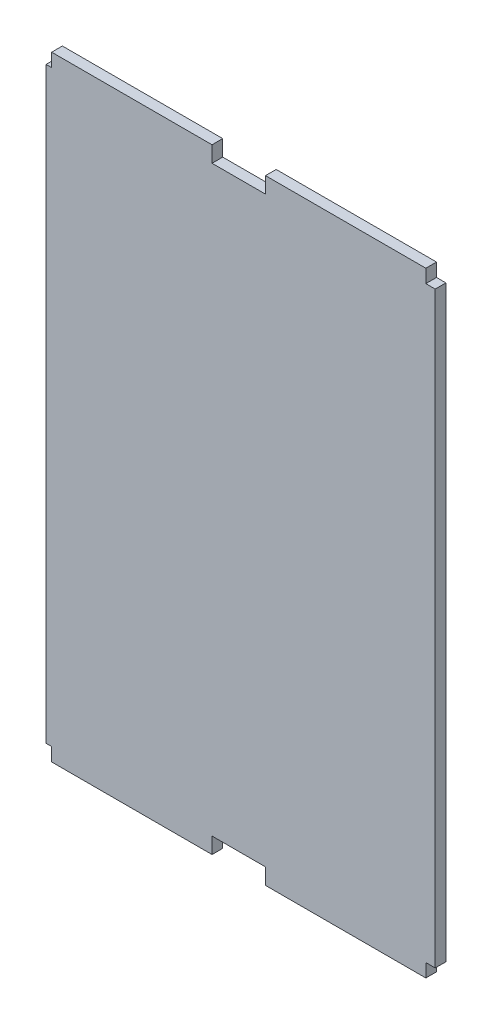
ISO-10303-21;
HEADER;
FILE_DESCRIPTION(('STEP AP214'),'2;1');
FILE_NAME('part.step','',(''),(''),'','','');
FILE_SCHEMA(('AUTOMOTIVE_DESIGN { 1 0 10303 214 1 1 1 1 }'));
ENDSEC;
DATA;
#1=APPLICATION_CONTEXT('core data for automotive mechanical design processes');
#2=APPLICATION_PROTOCOL_DEFINITION('international standard','automotive_design',2000,#1);
#3=PRODUCT_CONTEXT('',#1,'mechanical');
#4=PRODUCT('Part','Part','',(#3));
#5=PRODUCT_RELATED_PRODUCT_CATEGORY('part','',(#4));
#6=PRODUCT_DEFINITION_FORMATION('','',#4);
#7=PRODUCT_DEFINITION_CONTEXT('part definition',#1,'design');
#8=PRODUCT_DEFINITION('design','',#6,#7);
#9=PRODUCT_DEFINITION_SHAPE('','',#8);
#10=(LENGTH_UNIT() NAMED_UNIT(*) SI_UNIT(.MILLI.,.METRE.));
#11=(NAMED_UNIT(*) PLANE_ANGLE_UNIT() SI_UNIT($,.RADIAN.));
#12=(NAMED_UNIT(*) SI_UNIT($,.STERADIAN.) SOLID_ANGLE_UNIT());
#13=UNCERTAINTY_MEASURE_WITH_UNIT(LENGTH_MEASURE(1.E-05),#10,'distance_accuracy_value','');
#14=(GEOMETRIC_REPRESENTATION_CONTEXT(3) GLOBAL_UNCERTAINTY_ASSIGNED_CONTEXT((#13)) GLOBAL_UNIT_ASSIGNED_CONTEXT((#10,
#11,#12)) REPRESENTATION_CONTEXT('',''));
#15=CARTESIAN_POINT('',(0.,0.,0.));
#16=DIRECTION('',(0.,0.,1.));
#17=DIRECTION('',(1.,0.,0.));
#18=AXIS2_PLACEMENT_3D('',#15,#16,#17);
#19=CARTESIAN_POINT('',(35.,55.,2.));
#20=DIRECTION('',(0.,-1.,0.));
#21=DIRECTION('',(1.,0.,0.));
#22=AXIS2_PLACEMENT_3D('',#19,#20,#21);
#23=PLANE('',#22);
#24=DIRECTION('',(-1.,0.,0.));
#25=VECTOR('',#24,1.);
#26=CARTESIAN_POINT('',(35.,55.,2.));
#27=LINE('',#26,#25);
#28=CARTESIAN_POINT('',(36.7522293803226,55.,2.));
#29=VERTEX_POINT('',#28);
#30=CARTESIAN_POINT('',(35.,55.,2.));
#31=VERTEX_POINT('',#30);
#32=EDGE_CURVE('E254',#29,#31,#27,.T.);
#33=ORIENTED_EDGE('',*,*,#32,.F.);
#34=DIRECTION('',(0.,0.,1.));
#35=VECTOR('',#34,1.);
#36=CARTESIAN_POINT('',(36.7522293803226,55.,-1.));
#37=LINE('',#36,#35);
#38=CARTESIAN_POINT('',(36.7522293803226,55.,0.));
#39=VERTEX_POINT('',#38);
#40=EDGE_CURVE('E388',#39,#29,#37,.T.);
#41=ORIENTED_EDGE('',*,*,#40,.F.);
#42=DIRECTION('',(-1.,0.,0.));
#43=VECTOR('',#42,1.);
#44=CARTESIAN_POINT('',(35.,55.,0.));
#45=LINE('',#44,#43);
#46=CARTESIAN_POINT('',(35.,55.,0.));
#47=VERTEX_POINT('',#46);
#48=EDGE_CURVE('E216',#39,#47,#45,.T.);
#49=ORIENTED_EDGE('',*,*,#48,.T.);
#50=DIRECTION('',(0.,0.,-1.));
#51=VECTOR('',#50,1.);
#52=CARTESIAN_POINT('',(35.,55.,2.));
#53=LINE('',#52,#51);
#54=EDGE_CURVE('E297',#31,#47,#53,.T.);
#55=ORIENTED_EDGE('',*,*,#54,.F.);
#56=EDGE_LOOP('',(#33,#41,#49,#55));
#57=FACE_BOUND('',#56,.T.);
#58=ADVANCED_FACE('F39',(#57),#23,.F.);
#59=CARTESIAN_POINT('',(35.,57.5,2.));
#60=DIRECTION('',(-1.,0.,0.));
#61=DIRECTION('',(0.,-1.,0.));
#62=AXIS2_PLACEMENT_3D('',#59,#60,#61);
#63=PLANE('',#62);
#64=DIRECTION('',(0.,1.,0.));
#65=VECTOR('',#64,1.);
#66=CARTESIAN_POINT('',(35.,57.5,0.));
#67=LINE('',#66,#65);
#68=CARTESIAN_POINT('',(35.,57.5,0.));
#69=VERTEX_POINT('',#68);
#70=EDGE_CURVE('E218',#47,#69,#67,.T.);
#71=ORIENTED_EDGE('',*,*,#70,.T.);
#72=DIRECTION('',(0.,0.,-1.));
#73=VECTOR('',#72,1.);
#74=CARTESIAN_POINT('',(35.,57.5,2.));
#75=LINE('',#74,#73);
#76=CARTESIAN_POINT('',(35.,57.5,2.));
#77=VERTEX_POINT('',#76);
#78=EDGE_CURVE('E294',#77,#69,#75,.T.);
#79=ORIENTED_EDGE('',*,*,#78,.F.);
#80=DIRECTION('',(0.,1.,0.));
#81=VECTOR('',#80,1.);
#82=CARTESIAN_POINT('',(35.,57.5,2.));
#83=LINE('',#82,#81);
#84=EDGE_CURVE('E384',#31,#77,#83,.T.);
#85=ORIENTED_EDGE('',*,*,#84,.F.);
#86=ORIENTED_EDGE('',*,*,#54,.T.);
#87=EDGE_LOOP('',(#71,#79,#85,#86));
#88=FACE_BOUND('',#87,.T.);
#89=ADVANCED_FACE('F383',(#88),#63,.F.);
#90=CARTESIAN_POINT('',(4.99999999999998,57.5,2.));
#91=DIRECTION('',(0.,-1.,0.));
#92=DIRECTION('',(0.,0.,-1.));
#93=AXIS2_PLACEMENT_3D('',#90,#91,#92);
#94=PLANE('',#93);
#95=DIRECTION('',(-1.,0.,0.));
#96=VECTOR('',#95,1.);
#97=CARTESIAN_POINT('',(4.99999999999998,57.5,0.));
#98=LINE('',#97,#96);
#99=CARTESIAN_POINT('',(4.99999999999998,57.5,0.));
#100=VERTEX_POINT('',#99);
#101=EDGE_CURVE('E220',#69,#100,#98,.T.);
#102=ORIENTED_EDGE('',*,*,#101,.T.);
#103=DIRECTION('',(0.,0.,-1.));
#104=VECTOR('',#103,1.);
#105=CARTESIAN_POINT('',(4.99999999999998,57.5,2.));
#106=LINE('',#105,#104);
#107=CARTESIAN_POINT('',(4.99999999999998,57.5,2.));
#108=VERTEX_POINT('',#107);
#109=EDGE_CURVE('E291',#108,#100,#106,.T.);
#110=ORIENTED_EDGE('',*,*,#109,.F.);
#111=DIRECTION('',(-1.,0.,0.));
#112=VECTOR('',#111,1.);
#113=CARTESIAN_POINT('',(4.99999999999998,57.5,2.));
#114=LINE('',#113,#112);
#115=EDGE_CURVE('E379',#77,#108,#114,.T.);
#116=ORIENTED_EDGE('',*,*,#115,.F.);
#117=ORIENTED_EDGE('',*,*,#78,.T.);
#118=EDGE_LOOP('',(#102,#110,#116,#117));
#119=FACE_BOUND('',#118,.T.);
#120=ADVANCED_FACE('F378',(#119),#94,.F.);
#121=CARTESIAN_POINT('',(4.99999999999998,54.5,2.));
#122=DIRECTION('',(1.,0.,0.));
#123=DIRECTION('',(0.,0.,-1.));
#124=AXIS2_PLACEMENT_3D('',#121,#122,#123);
#125=PLANE('',#124);
#126=DIRECTION('',(0.,-1.,0.));
#127=VECTOR('',#126,1.);
#128=CARTESIAN_POINT('',(4.99999999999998,54.5,0.));
#129=LINE('',#128,#127);
#130=CARTESIAN_POINT('',(4.99999999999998,54.5,0.));
#131=VERTEX_POINT('',#130);
#132=EDGE_CURVE('E222',#100,#131,#129,.T.);
#133=ORIENTED_EDGE('',*,*,#132,.T.);
#134=DIRECTION('',(0.,0.,-1.));
#135=VECTOR('',#134,1.);
#136=CARTESIAN_POINT('',(4.99999999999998,54.5,2.));
#137=LINE('',#136,#135);
#138=CARTESIAN_POINT('',(4.99999999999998,54.5,2.));
#139=VERTEX_POINT('',#138);
#140=EDGE_CURVE('E288',#139,#131,#137,.T.);
#141=ORIENTED_EDGE('',*,*,#140,.F.);
#142=DIRECTION('',(0.,-1.,0.));
#143=VECTOR('',#142,1.);
#144=CARTESIAN_POINT('',(4.99999999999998,54.5,2.));
#145=LINE('',#144,#143);
#146=EDGE_CURVE('E375',#108,#139,#145,.T.);
#147=ORIENTED_EDGE('',*,*,#146,.F.);
#148=ORIENTED_EDGE('',*,*,#109,.T.);
#149=EDGE_LOOP('',(#133,#141,#147,#148));
#150=FACE_BOUND('',#149,.T.);
#151=ADVANCED_FACE('F372',(#150),#125,.F.);
#152=CARTESIAN_POINT('',(-5.00000000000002,54.5,2.));
#153=DIRECTION('',(0.,-1.,0.));
#154=DIRECTION('',(0.,0.,-1.));
#155=AXIS2_PLACEMENT_3D('',#152,#153,#154);
#156=PLANE('',#155);
#157=DIRECTION('',(-1.,0.,0.));
#158=VECTOR('',#157,1.);
#159=CARTESIAN_POINT('',(-5.00000000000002,54.5,0.));
#160=LINE('',#159,#158);
#161=CARTESIAN_POINT('',(-5.00000000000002,54.5,0.));
#162=VERTEX_POINT('',#161);
#163=EDGE_CURVE('E224',#131,#162,#160,.T.);
#164=ORIENTED_EDGE('',*,*,#163,.T.);
#165=DIRECTION('',(0.,0.,-1.));
#166=VECTOR('',#165,1.);
#167=CARTESIAN_POINT('',(-5.00000000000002,54.5,2.));
#168=LINE('',#167,#166);
#169=CARTESIAN_POINT('',(-5.00000000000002,54.5,2.));
#170=VERTEX_POINT('',#169);
#171=EDGE_CURVE('E285',#170,#162,#168,.T.);
#172=ORIENTED_EDGE('',*,*,#171,.F.);
#173=DIRECTION('',(-1.,0.,0.));
#174=VECTOR('',#173,1.);
#175=CARTESIAN_POINT('',(-5.00000000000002,54.5,2.));
#176=LINE('',#175,#174);
#177=EDGE_CURVE('E367',#139,#170,#176,.T.);
#178=ORIENTED_EDGE('',*,*,#177,.F.);
#179=ORIENTED_EDGE('',*,*,#140,.T.);
#180=EDGE_LOOP('',(#164,#172,#178,#179));
#181=FACE_BOUND('',#180,.T.);
#182=ADVANCED_FACE('F366',(#181),#156,.F.);
#183=CARTESIAN_POINT('',(-5.00000000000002,57.5,2.));
#184=DIRECTION('',(-1.,0.,0.));
#185=DIRECTION('',(0.,0.,1.));
#186=AXIS2_PLACEMENT_3D('',#183,#184,#185);
#187=PLANE('',#186);
#188=DIRECTION('',(0.,1.,0.));
#189=VECTOR('',#188,1.);
#190=CARTESIAN_POINT('',(-5.00000000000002,57.5,0.));
#191=LINE('',#190,#189);
#192=CARTESIAN_POINT('',(-5.00000000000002,57.5,0.));
#193=VERTEX_POINT('',#192);
#194=EDGE_CURVE('E226',#162,#193,#191,.T.);
#195=ORIENTED_EDGE('',*,*,#194,.T.);
#196=DIRECTION('',(0.,0.,-1.));
#197=VECTOR('',#196,1.);
#198=CARTESIAN_POINT('',(-5.00000000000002,57.5,2.));
#199=LINE('',#198,#197);
#200=CARTESIAN_POINT('',(-5.00000000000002,57.5,2.));
#201=VERTEX_POINT('',#200);
#202=EDGE_CURVE('E282',#201,#193,#199,.T.);
#203=ORIENTED_EDGE('',*,*,#202,.F.);
#204=DIRECTION('',(0.,1.,0.));
#205=VECTOR('',#204,1.);
#206=CARTESIAN_POINT('',(-5.00000000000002,57.5,2.));
#207=LINE('',#206,#205);
#208=EDGE_CURVE('E362',#170,#201,#207,.T.);
#209=ORIENTED_EDGE('',*,*,#208,.F.);
#210=ORIENTED_EDGE('',*,*,#171,.T.);
#211=EDGE_LOOP('',(#195,#203,#209,#210));
#212=FACE_BOUND('',#211,.T.);
#213=ADVANCED_FACE('F361',(#212),#187,.F.);
#214=CARTESIAN_POINT('',(-35.,57.5,2.));
#215=DIRECTION('',(0.,-1.,0.));
#216=DIRECTION('',(0.,0.,-1.));
#217=AXIS2_PLACEMENT_3D('',#214,#215,#216);
#218=PLANE('',#217);
#219=DIRECTION('',(-1.,0.,0.));
#220=VECTOR('',#219,1.);
#221=CARTESIAN_POINT('',(-35.,57.5,0.));
#222=LINE('',#221,#220);
#223=CARTESIAN_POINT('',(-35.,57.5,0.));
#224=VERTEX_POINT('',#223);
#225=EDGE_CURVE('E228',#193,#224,#222,.T.);
#226=ORIENTED_EDGE('',*,*,#225,.T.);
#227=DIRECTION('',(0.,0.,-1.));
#228=VECTOR('',#227,1.);
#229=CARTESIAN_POINT('',(-35.,57.5,2.));
#230=LINE('',#229,#228);
#231=CARTESIAN_POINT('',(-35.,57.5,2.));
#232=VERTEX_POINT('',#231);
#233=EDGE_CURVE('E279',#232,#224,#230,.T.);
#234=ORIENTED_EDGE('',*,*,#233,.F.);
#235=DIRECTION('',(-1.,0.,0.));
#236=VECTOR('',#235,1.);
#237=CARTESIAN_POINT('',(-35.,57.5,2.));
#238=LINE('',#237,#236);
#239=EDGE_CURVE('E358',#201,#232,#238,.T.);
#240=ORIENTED_EDGE('',*,*,#239,.F.);
#241=ORIENTED_EDGE('',*,*,#202,.T.);
#242=EDGE_LOOP('',(#226,#234,#240,#241));
#243=FACE_BOUND('',#242,.T.);
#244=ADVANCED_FACE('F355',(#243),#218,.F.);
#245=CARTESIAN_POINT('',(-35.,55.0000000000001,2.));
#246=DIRECTION('',(1.,0.,0.));
#247=DIRECTION('',(0.,1.,0.));
#248=AXIS2_PLACEMENT_3D('',#245,#246,#247);
#249=PLANE('',#248);
#250=DIRECTION('',(0.,-1.,0.));
#251=VECTOR('',#250,1.);
#252=CARTESIAN_POINT('',(-35.,55.0000000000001,0.));
#253=LINE('',#252,#251);
#254=CARTESIAN_POINT('',(-35.,55.0000000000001,0.));
#255=VERTEX_POINT('',#254);
#256=EDGE_CURVE('E230',#224,#255,#253,.T.);
#257=ORIENTED_EDGE('',*,*,#256,.T.);
#258=DIRECTION('',(0.,0.,-1.));
#259=VECTOR('',#258,1.);
#260=CARTESIAN_POINT('',(-35.,55.0000000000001,2.));
#261=LINE('',#260,#259);
#262=CARTESIAN_POINT('',(-35.,55.0000000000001,2.));
#263=VERTEX_POINT('',#262);
#264=EDGE_CURVE('E276',#263,#255,#261,.T.);
#265=ORIENTED_EDGE('',*,*,#264,.F.);
#266=DIRECTION('',(0.,-1.,0.));
#267=VECTOR('',#266,1.);
#268=CARTESIAN_POINT('',(-35.,55.0000000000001,2.));
#269=LINE('',#268,#267);
#270=EDGE_CURVE('E197',#232,#263,#269,.T.);
#271=ORIENTED_EDGE('',*,*,#270,.F.);
#272=ORIENTED_EDGE('',*,*,#233,.T.);
#273=EDGE_LOOP('',(#257,#265,#271,#272));
#274=FACE_BOUND('',#273,.T.);
#275=ADVANCED_FACE('F349',(#274),#249,.F.);
#276=CARTESIAN_POINT('',(-45.,55.,2.));
#277=DIRECTION('',(0.,-1.,0.));
#278=DIRECTION('',(1.,0.,0.));
#279=AXIS2_PLACEMENT_3D('',#276,#277,#278);
#280=PLANE('',#279);
#281=DIRECTION('',(-1.,0.,0.));
#282=VECTOR('',#281,1.);
#283=CARTESIAN_POINT('',(-45.,55.,0.));
#284=LINE('',#283,#282);
#285=CARTESIAN_POINT('',(-36.042726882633,55.,0.));
#286=VERTEX_POINT('',#285);
#287=EDGE_CURVE('E232',#255,#286,#284,.T.);
#288=ORIENTED_EDGE('',*,*,#287,.T.);
#289=DIRECTION('',(0.,0.,1.));
#290=VECTOR('',#289,1.);
#291=CARTESIAN_POINT('',(-36.042726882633,55.,-1.));
#292=LINE('',#291,#290);
#293=CARTESIAN_POINT('',(-36.042726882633,55.,2.));
#294=VERTEX_POINT('',#293);
#295=EDGE_CURVE('E53',#286,#294,#292,.T.);
#296=ORIENTED_EDGE('',*,*,#295,.T.);
#297=DIRECTION('',(-1.,0.,0.));
#298=VECTOR('',#297,1.);
#299=CARTESIAN_POINT('',(-45.,55.,2.));
#300=LINE('',#299,#298);
#301=EDGE_CURVE('E186',#263,#294,#300,.T.);
#302=ORIENTED_EDGE('',*,*,#301,.F.);
#303=ORIENTED_EDGE('',*,*,#264,.T.);
#304=EDGE_LOOP('',(#288,#296,#302,#303));
#305=FACE_BOUND('',#304,.T.);
#306=ADVANCED_FACE('F345',(#305),#280,.F.);
#307=CARTESIAN_POINT('',(-45.,-55.,2.));
#308=DIRECTION('',(0.,1.,0.));
#309=DIRECTION('',(0.,0.,1.));
#310=AXIS2_PLACEMENT_3D('',#307,#308,#309);
#311=PLANE('',#310);
#312=DIRECTION('',(1.,0.,0.));
#313=VECTOR('',#312,1.);
#314=CARTESIAN_POINT('',(-45.,-55.,2.));
#315=LINE('',#314,#313);
#316=CARTESIAN_POINT('',(-36.042726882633,-55.,2.));
#317=VERTEX_POINT('',#316);
#318=CARTESIAN_POINT('',(-35.,-55.,2.));
#319=VERTEX_POINT('',#318);
#320=EDGE_CURVE('E183',#317,#319,#315,.T.);
#321=ORIENTED_EDGE('',*,*,#320,.F.);
#322=DIRECTION('',(0.,0.,1.));
#323=VECTOR('',#322,1.);
#324=CARTESIAN_POINT('',(-36.042726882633,-55.,-1.));
#325=LINE('',#324,#323);
#326=CARTESIAN_POINT('',(-36.042726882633,-55.,0.));
#327=VERTEX_POINT('',#326);
#328=EDGE_CURVE('E172',#327,#317,#325,.T.);
#329=ORIENTED_EDGE('',*,*,#328,.F.);
#330=DIRECTION('',(1.,0.,0.));
#331=VECTOR('',#330,1.);
#332=CARTESIAN_POINT('',(-45.,-55.,0.));
#333=LINE('',#332,#331);
#334=CARTESIAN_POINT('',(-35.,-55.,0.));
#335=VERTEX_POINT('',#334);
#336=EDGE_CURVE('E235',#327,#335,#333,.T.);
#337=ORIENTED_EDGE('',*,*,#336,.T.);
#338=DIRECTION('',(0.,0.,-1.));
#339=VECTOR('',#338,1.);
#340=CARTESIAN_POINT('',(-35.,-55.,2.));
#341=LINE('',#340,#339);
#342=EDGE_CURVE('E191',#319,#335,#341,.T.);
#343=ORIENTED_EDGE('',*,*,#342,.F.);
#344=EDGE_LOOP('',(#321,#329,#337,#343));
#345=FACE_BOUND('',#344,.T.);
#346=ADVANCED_FACE('F189',(#345),#311,.F.);
#347=CARTESIAN_POINT('',(-35.,-55.,2.));
#348=DIRECTION('',(1.,0.,0.));
#349=DIRECTION('',(0.,1.,0.));
#350=AXIS2_PLACEMENT_3D('',#347,#348,#349);
#351=PLANE('',#350);
#352=DIRECTION('',(0.,-1.,0.));
#353=VECTOR('',#352,1.);
#354=CARTESIAN_POINT('',(-35.,-55.,0.));
#355=LINE('',#354,#353);
#356=CARTESIAN_POINT('',(-35.,-57.5,0.));
#357=VERTEX_POINT('',#356);
#358=EDGE_CURVE('E237',#335,#357,#355,.T.);
#359=ORIENTED_EDGE('',*,*,#358,.T.);
#360=DIRECTION('',(0.,0.,-1.));
#361=VECTOR('',#360,1.);
#362=CARTESIAN_POINT('',(-35.,-57.5,2.));
#363=LINE('',#362,#361);
#364=CARTESIAN_POINT('',(-35.,-57.5,2.));
#365=VERTEX_POINT('',#364);
#366=EDGE_CURVE('E272',#365,#357,#363,.T.);
#367=ORIENTED_EDGE('',*,*,#366,.F.);
#368=DIRECTION('',(0.,-1.,0.));
#369=VECTOR('',#368,1.);
#370=CARTESIAN_POINT('',(-35.,-55.,2.));
#371=LINE('',#370,#369);
#372=EDGE_CURVE('E193',#319,#365,#371,.T.);
#373=ORIENTED_EDGE('',*,*,#372,.F.);
#374=ORIENTED_EDGE('',*,*,#342,.T.);
#375=EDGE_LOOP('',(#359,#367,#373,#374));
#376=FACE_BOUND('',#375,.T.);
#377=ADVANCED_FACE('F341',(#376),#351,.F.);
#378=CARTESIAN_POINT('',(-35.,-57.5,2.));
#379=DIRECTION('',(0.,1.,0.));
#380=DIRECTION('',(0.,0.,1.));
#381=AXIS2_PLACEMENT_3D('',#378,#379,#380);
#382=PLANE('',#381);
#383=DIRECTION('',(1.,0.,0.));
#384=VECTOR('',#383,1.);
#385=CARTESIAN_POINT('',(-35.,-57.5,0.));
#386=LINE('',#385,#384);
#387=CARTESIAN_POINT('',(-5.00000000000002,-57.5,0.));
#388=VERTEX_POINT('',#387);
#389=EDGE_CURVE('E239',#357,#388,#386,.T.);
#390=ORIENTED_EDGE('',*,*,#389,.T.);
#391=DIRECTION('',(0.,0.,-1.));
#392=VECTOR('',#391,1.);
#393=CARTESIAN_POINT('',(-5.00000000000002,-57.5,2.));
#394=LINE('',#393,#392);
#395=CARTESIAN_POINT('',(-5.00000000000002,-57.5,2.));
#396=VERTEX_POINT('',#395);
#397=EDGE_CURVE('E269',#396,#388,#394,.T.);
#398=ORIENTED_EDGE('',*,*,#397,.F.);
#399=DIRECTION('',(1.,0.,0.));
#400=VECTOR('',#399,1.);
#401=CARTESIAN_POINT('',(-35.,-57.5,2.));
#402=LINE('',#401,#400);
#403=EDGE_CURVE('E195',#365,#396,#402,.T.);
#404=ORIENTED_EDGE('',*,*,#403,.F.);
#405=ORIENTED_EDGE('',*,*,#366,.T.);
#406=EDGE_LOOP('',(#390,#398,#404,#405));
#407=FACE_BOUND('',#406,.T.);
#408=ADVANCED_FACE('F338',(#407),#382,.F.);
#409=CARTESIAN_POINT('',(-5.00000000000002,-57.5,2.));
#410=DIRECTION('',(-1.,0.,0.));
#411=DIRECTION('',(0.,0.,1.));
#412=AXIS2_PLACEMENT_3D('',#409,#410,#411);
#413=PLANE('',#412);
#414=DIRECTION('',(0.,1.,0.));
#415=VECTOR('',#414,1.);
#416=CARTESIAN_POINT('',(-5.00000000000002,-57.5,0.));
#417=LINE('',#416,#415);
#418=CARTESIAN_POINT('',(-5.00000000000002,-54.5,0.));
#419=VERTEX_POINT('',#418);
#420=EDGE_CURVE('E241',#388,#419,#417,.T.);
#421=ORIENTED_EDGE('',*,*,#420,.T.);
#422=DIRECTION('',(0.,0.,-1.));
#423=VECTOR('',#422,1.);
#424=CARTESIAN_POINT('',(-5.00000000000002,-54.5,2.));
#425=LINE('',#424,#423);
#426=CARTESIAN_POINT('',(-5.00000000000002,-54.5,2.));
#427=VERTEX_POINT('',#426);
#428=EDGE_CURVE('E266',#427,#419,#425,.T.);
#429=ORIENTED_EDGE('',*,*,#428,.F.);
#430=DIRECTION('',(0.,1.,0.));
#431=VECTOR('',#430,1.);
#432=CARTESIAN_POINT('',(-5.00000000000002,-57.5,2.));
#433=LINE('',#432,#431);
#434=EDGE_CURVE('E202',#396,#427,#433,.T.);
#435=ORIENTED_EDGE('',*,*,#434,.F.);
#436=ORIENTED_EDGE('',*,*,#397,.T.);
#437=EDGE_LOOP('',(#421,#429,#435,#436));
#438=FACE_BOUND('',#437,.T.);
#439=ADVANCED_FACE('F333',(#438),#413,.F.);
#440=CARTESIAN_POINT('',(-5.00000000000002,-54.5,2.));
#441=DIRECTION('',(0.,1.,0.));
#442=DIRECTION('',(0.,0.,1.));
#443=AXIS2_PLACEMENT_3D('',#440,#441,#442);
#444=PLANE('',#443);
#445=DIRECTION('',(1.,0.,0.));
#446=VECTOR('',#445,1.);
#447=CARTESIAN_POINT('',(-5.00000000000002,-54.5,0.));
#448=LINE('',#447,#446);
#449=CARTESIAN_POINT('',(4.99999999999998,-54.5,0.));
#450=VERTEX_POINT('',#449);
#451=EDGE_CURVE('E243',#419,#450,#448,.T.);
#452=ORIENTED_EDGE('',*,*,#451,.T.);
#453=DIRECTION('',(0.,0.,-1.));
#454=VECTOR('',#453,1.);
#455=CARTESIAN_POINT('',(4.99999999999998,-54.5,2.));
#456=LINE('',#455,#454);
#457=CARTESIAN_POINT('',(4.99999999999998,-54.5,2.));
#458=VERTEX_POINT('',#457);
#459=EDGE_CURVE('E263',#458,#450,#456,.T.);
#460=ORIENTED_EDGE('',*,*,#459,.F.);
#461=DIRECTION('',(1.,0.,0.));
#462=VECTOR('',#461,1.);
#463=CARTESIAN_POINT('',(-5.00000000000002,-54.5,2.));
#464=LINE('',#463,#462);
#465=EDGE_CURVE('E204',#427,#458,#464,.T.);
#466=ORIENTED_EDGE('',*,*,#465,.F.);
#467=ORIENTED_EDGE('',*,*,#428,.T.);
#468=EDGE_LOOP('',(#452,#460,#466,#467));
#469=FACE_BOUND('',#468,.T.);
#470=ADVANCED_FACE('F327',(#469),#444,.F.);
#471=CARTESIAN_POINT('',(4.99999999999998,-54.5,2.));
#472=DIRECTION('',(1.,0.,0.));
#473=DIRECTION('',(0.,0.,-1.));
#474=AXIS2_PLACEMENT_3D('',#471,#472,#473);
#475=PLANE('',#474);
#476=DIRECTION('',(0.,-1.,0.));
#477=VECTOR('',#476,1.);
#478=CARTESIAN_POINT('',(4.99999999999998,-54.5,0.));
#479=LINE('',#478,#477);
#480=CARTESIAN_POINT('',(4.99999999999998,-57.5,0.));
#481=VERTEX_POINT('',#480);
#482=EDGE_CURVE('E245',#450,#481,#479,.T.);
#483=ORIENTED_EDGE('',*,*,#482,.T.);
#484=DIRECTION('',(0.,0.,-1.));
#485=VECTOR('',#484,1.);
#486=CARTESIAN_POINT('',(4.99999999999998,-57.5,2.));
#487=LINE('',#486,#485);
#488=CARTESIAN_POINT('',(4.99999999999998,-57.5,2.));
#489=VERTEX_POINT('',#488);
#490=EDGE_CURVE('E260',#489,#481,#487,.T.);
#491=ORIENTED_EDGE('',*,*,#490,.F.);
#492=DIRECTION('',(0.,-1.,0.));
#493=VECTOR('',#492,1.);
#494=CARTESIAN_POINT('',(4.99999999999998,-54.5,2.));
#495=LINE('',#494,#493);
#496=EDGE_CURVE('E206',#458,#489,#495,.T.);
#497=ORIENTED_EDGE('',*,*,#496,.F.);
#498=ORIENTED_EDGE('',*,*,#459,.T.);
#499=EDGE_LOOP('',(#483,#491,#497,#498));
#500=FACE_BOUND('',#499,.T.);
#501=ADVANCED_FACE('F323',(#500),#475,.F.);
#502=CARTESIAN_POINT('',(4.99999999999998,-57.5,2.));
#503=DIRECTION('',(0.,1.,0.));
#504=DIRECTION('',(0.,0.,1.));
#505=AXIS2_PLACEMENT_3D('',#502,#503,#504);
#506=PLANE('',#505);
#507=DIRECTION('',(1.,0.,0.));
#508=VECTOR('',#507,1.);
#509=CARTESIAN_POINT('',(4.99999999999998,-57.5,0.));
#510=LINE('',#509,#508);
#511=CARTESIAN_POINT('',(35.,-57.5,0.));
#512=VERTEX_POINT('',#511);
#513=EDGE_CURVE('E247',#481,#512,#510,.T.);
#514=ORIENTED_EDGE('',*,*,#513,.T.);
#515=DIRECTION('',(0.,0.,-1.));
#516=VECTOR('',#515,1.);
#517=CARTESIAN_POINT('',(35.,-57.5,2.));
#518=LINE('',#517,#516);
#519=CARTESIAN_POINT('',(35.,-57.5,2.));
#520=VERTEX_POINT('',#519);
#521=EDGE_CURVE('E257',#520,#512,#518,.T.);
#522=ORIENTED_EDGE('',*,*,#521,.F.);
#523=DIRECTION('',(1.,0.,0.));
#524=VECTOR('',#523,1.);
#525=CARTESIAN_POINT('',(4.99999999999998,-57.5,2.));
#526=LINE('',#525,#524);
#527=EDGE_CURVE('E208',#489,#520,#526,.T.);
#528=ORIENTED_EDGE('',*,*,#527,.F.);
#529=ORIENTED_EDGE('',*,*,#490,.T.);
#530=EDGE_LOOP('',(#514,#522,#528,#529));
#531=FACE_BOUND('',#530,.T.);
#532=ADVANCED_FACE('F318',(#531),#506,.F.);
#533=CARTESIAN_POINT('',(35.,-57.5,2.));
#534=DIRECTION('',(-1.,0.,0.));
#535=DIRECTION('',(0.,-1.,0.));
#536=AXIS2_PLACEMENT_3D('',#533,#534,#535);
#537=PLANE('',#536);
#538=DIRECTION('',(0.,1.,0.));
#539=VECTOR('',#538,1.);
#540=CARTESIAN_POINT('',(35.,-57.5,0.));
#541=LINE('',#540,#539);
#542=CARTESIAN_POINT('',(35.,-55.,0.));
#543=VERTEX_POINT('',#542);
#544=EDGE_CURVE('E249',#512,#543,#541,.T.);
#545=ORIENTED_EDGE('',*,*,#544,.T.);
#546=DIRECTION('',(0.,0.,-1.));
#547=VECTOR('',#546,1.);
#548=CARTESIAN_POINT('',(35.,-55.,2.));
#549=LINE('',#548,#547);
#550=CARTESIAN_POINT('',(35.,-55.,2.));
#551=VERTEX_POINT('',#550);
#552=EDGE_CURVE('E215',#551,#543,#549,.T.);
#553=ORIENTED_EDGE('',*,*,#552,.F.);
#554=DIRECTION('',(0.,1.,0.));
#555=VECTOR('',#554,1.);
#556=CARTESIAN_POINT('',(35.,-57.5,2.));
#557=LINE('',#556,#555);
#558=EDGE_CURVE('E210',#520,#551,#557,.T.);
#559=ORIENTED_EDGE('',*,*,#558,.F.);
#560=ORIENTED_EDGE('',*,*,#521,.T.);
#561=EDGE_LOOP('',(#545,#553,#559,#560));
#562=FACE_BOUND('',#561,.T.);
#563=ADVANCED_FACE('F312',(#562),#537,.F.);
#564=CARTESIAN_POINT('',(35.,-55.,2.));
#565=DIRECTION('',(0.,1.,0.));
#566=DIRECTION('',(0.,0.,1.));
#567=AXIS2_PLACEMENT_3D('',#564,#565,#566);
#568=PLANE('',#567);
#569=DIRECTION('',(1.,0.,0.));
#570=VECTOR('',#569,1.);
#571=CARTESIAN_POINT('',(35.,-55.,0.));
#572=LINE('',#571,#570);
#573=CARTESIAN_POINT('',(36.7522293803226,-55.,0.));
#574=VERTEX_POINT('',#573);
#575=EDGE_CURVE('E251',#543,#574,#572,.T.);
#576=ORIENTED_EDGE('',*,*,#575,.T.);
#577=DIRECTION('',(0.,0.,1.));
#578=VECTOR('',#577,1.);
#579=CARTESIAN_POINT('',(36.7522293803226,-55.,-1.));
#580=LINE('',#579,#578);
#581=CARTESIAN_POINT('',(36.7522293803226,-55.,2.));
#582=VERTEX_POINT('',#581);
#583=EDGE_CURVE('E60',#574,#582,#580,.T.);
#584=ORIENTED_EDGE('',*,*,#583,.T.);
#585=DIRECTION('',(1.,0.,0.));
#586=VECTOR('',#585,1.);
#587=CARTESIAN_POINT('',(35.,-55.,2.));
#588=LINE('',#587,#586);
#589=EDGE_CURVE('E212',#551,#582,#588,.T.);
#590=ORIENTED_EDGE('',*,*,#589,.F.);
#591=ORIENTED_EDGE('',*,*,#552,.T.);
#592=EDGE_LOOP('',(#576,#584,#590,#591));
#593=FACE_BOUND('',#592,.T.);
#594=ADVANCED_FACE('F307',(#593),#568,.F.);
#595=CARTESIAN_POINT('',(0.,0.,2.));
#596=DIRECTION('',(0.,0.,1.));
#597=DIRECTION('',(1.,0.,0.));
#598=AXIS2_PLACEMENT_3D('',#595,#596,#597);
#599=PLANE('',#598);
#600=DIRECTION('',(0.,1.,0.));
#601=VECTOR('',#600,1.);
#602=CARTESIAN_POINT('',(-36.042726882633,55.,2.));
#603=LINE('',#602,#601);
#604=EDGE_CURVE('E175',#317,#294,#603,.T.);
#605=ORIENTED_EDGE('',*,*,#604,.F.);
#606=ORIENTED_EDGE('',*,*,#320,.T.);
#607=ORIENTED_EDGE('',*,*,#372,.T.);
#608=ORIENTED_EDGE('',*,*,#403,.T.);
#609=ORIENTED_EDGE('',*,*,#434,.T.);
#610=ORIENTED_EDGE('',*,*,#465,.T.);
#611=ORIENTED_EDGE('',*,*,#496,.T.);
#612=ORIENTED_EDGE('',*,*,#527,.T.);
#613=ORIENTED_EDGE('',*,*,#558,.T.);
#614=ORIENTED_EDGE('',*,*,#589,.T.);
#615=DIRECTION('',(0.,-1.,0.));
#616=VECTOR('',#615,1.);
#617=CARTESIAN_POINT('',(36.7522293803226,55.,2.));
#618=LINE('',#617,#616);
#619=EDGE_CURVE('E187',#29,#582,#618,.T.);
#620=ORIENTED_EDGE('',*,*,#619,.F.);
#621=ORIENTED_EDGE('',*,*,#32,.T.);
#622=ORIENTED_EDGE('',*,*,#84,.T.);
#623=ORIENTED_EDGE('',*,*,#115,.T.);
#624=ORIENTED_EDGE('',*,*,#146,.T.);
#625=ORIENTED_EDGE('',*,*,#177,.T.);
#626=ORIENTED_EDGE('',*,*,#208,.T.);
#627=ORIENTED_EDGE('',*,*,#239,.T.);
#628=ORIENTED_EDGE('',*,*,#270,.T.);
#629=ORIENTED_EDGE('',*,*,#301,.T.);
#630=EDGE_LOOP('',(#605,#606,#607,#608,#609,#610,#611,#612,#613,#614,#620,#621,#622,#623,#624,
#625,#626,#627,#628,#629));
#631=FACE_BOUND('',#630,.T.);
#632=ADVANCED_FACE('F182',(#631),#599,.T.);
#633=CARTESIAN_POINT('',(0.,0.,0.));
#634=DIRECTION('',(0.,0.,1.));
#635=DIRECTION('',(1.,0.,0.));
#636=AXIS2_PLACEMENT_3D('',#633,#634,#635);
#637=PLANE('',#636);
#638=ORIENTED_EDGE('',*,*,#336,.F.);
#639=DIRECTION('',(0.,1.,0.));
#640=VECTOR('',#639,1.);
#641=CARTESIAN_POINT('',(-36.042726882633,0.,0.));
#642=LINE('',#641,#640);
#643=EDGE_CURVE('E11',#327,#286,#642,.T.);
#644=ORIENTED_EDGE('',*,*,#643,.T.);
#645=ORIENTED_EDGE('',*,*,#287,.F.);
#646=ORIENTED_EDGE('',*,*,#256,.F.);
#647=ORIENTED_EDGE('',*,*,#225,.F.);
#648=ORIENTED_EDGE('',*,*,#194,.F.);
#649=ORIENTED_EDGE('',*,*,#163,.F.);
#650=ORIENTED_EDGE('',*,*,#132,.F.);
#651=ORIENTED_EDGE('',*,*,#101,.F.);
#652=ORIENTED_EDGE('',*,*,#70,.F.);
#653=ORIENTED_EDGE('',*,*,#48,.F.);
#654=DIRECTION('',(0.,-1.,0.));
#655=VECTOR('',#654,1.);
#656=CARTESIAN_POINT('',(36.7522293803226,0.,0.));
#657=LINE('',#656,#655);
#658=EDGE_CURVE('E46',#39,#574,#657,.T.);
#659=ORIENTED_EDGE('',*,*,#658,.T.);
#660=ORIENTED_EDGE('',*,*,#575,.F.);
#661=ORIENTED_EDGE('',*,*,#544,.F.);
#662=ORIENTED_EDGE('',*,*,#513,.F.);
#663=ORIENTED_EDGE('',*,*,#482,.F.);
#664=ORIENTED_EDGE('',*,*,#451,.F.);
#665=ORIENTED_EDGE('',*,*,#420,.F.);
#666=ORIENTED_EDGE('',*,*,#389,.F.);
#667=ORIENTED_EDGE('',*,*,#358,.F.);
#668=EDGE_LOOP('',(#638,#644,#645,#646,#647,#648,#649,#650,#651,#652,#653,#659,#660,#661,#662,
#663,#664,#665,#666,#667));
#669=FACE_BOUND('',#668,.T.);
#670=ADVANCED_FACE('F302',(#669),#637,.F.);
#671=CARTESIAN_POINT('',(36.7522293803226,55.,-1.));
#672=DIRECTION('',(-1.,0.,0.));
#673=DIRECTION('',(0.,-1.,0.));
#674=AXIS2_PLACEMENT_3D('',#671,#672,#673);
#675=PLANE('',#674);
#676=ORIENTED_EDGE('',*,*,#40,.T.);
#677=ORIENTED_EDGE('',*,*,#619,.T.);
#678=ORIENTED_EDGE('',*,*,#583,.F.);
#679=ORIENTED_EDGE('',*,*,#658,.F.);
#680=EDGE_LOOP('',(#676,#677,#678,#679));
#681=FACE_BOUND('',#680,.T.);
#682=ADVANCED_FACE('F401',(#681),#675,.F.);
#683=CARTESIAN_POINT('',(-36.042726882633,55.,-1.));
#684=DIRECTION('',(1.,0.,0.));
#685=DIRECTION('',(0.,1.,0.));
#686=AXIS2_PLACEMENT_3D('',#683,#684,#685);
#687=PLANE('',#686);
#688=ORIENTED_EDGE('',*,*,#328,.T.);
#689=ORIENTED_EDGE('',*,*,#604,.T.);
#690=ORIENTED_EDGE('',*,*,#295,.F.);
#691=ORIENTED_EDGE('',*,*,#643,.F.);
#692=EDGE_LOOP('',(#688,#689,#690,#691));
#693=FACE_BOUND('',#692,.T.);
#694=ADVANCED_FACE('F174',(#693),#687,.F.);
#695=CLOSED_SHELL('',(#58,#89,#120,#151,#182,#213,#244,#275,#306,#346,#377,#408,#439,#470,#501,
#532,#563,#594,#632,#670,#682,#694));
#696=MANIFOLD_SOLID_BREP('B2',#695);
#697=ADVANCED_BREP_SHAPE_REPRESENTATION('',(#18,#696),#14);
#698=SHAPE_DEFINITION_REPRESENTATION(#9,#697);
ENDSEC;
END-ISO-10303-21;
